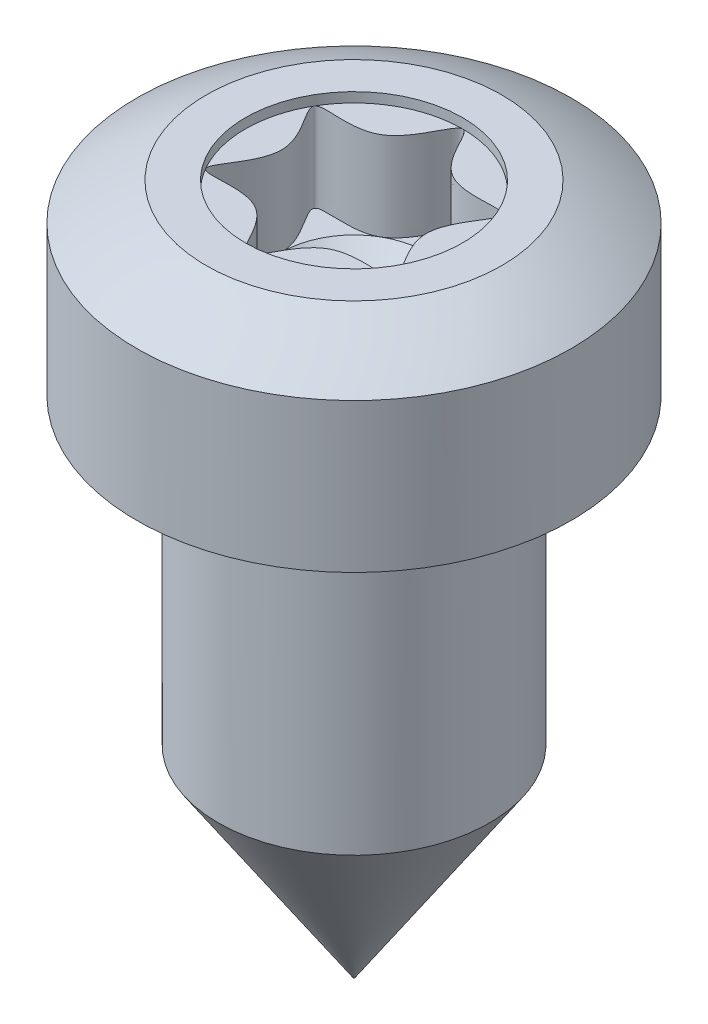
from build123d import *

# Parameters (mm, degrees)
RECESS_CUT_EXTRUDE1_DEPTH = 1.27
SKETCH5_R                 = 1.4
RECESS_CUT_EXTRUDE2_DEPTH = 0.127
FILLET1_R                 = 0.1


with BuildPart() as part:
    # Sketch1 → Body-Revolve (revolve)
    with BuildSketch(Plane.XY, mode=Mode.PRIVATE) as body_revolve_sk:
        Polygon((0, 0), (0, 8.9), (2.8, 8.9), (2.8, 6.5), (1.75, 6.5), (1.75, 0), align=None)
    revolve(body_revolve_sk.sketch.rotate(Axis((0, 0, 0), (0, 1, 0)), 90), axis=Axis((0, 0, 0), (0, 1, 0)))

    # Sketch3 → Head-Cut-Revolve (revolve, cut)
    with BuildSketch(Plane.XY, mode=Mode.PRIVATE) as head_cut_revolve_sk:
        with BuildLine():
            Line((0, 9.277536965), (0, 10.404372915))
            Line((0, 10.404372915), (5, 10.404372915))
            Line((5, 10.404372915), (5, 4.277536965))
            ThreePointArc((5, 4.277536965), (3.535533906, 7.81307087), (0, 9.277536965))
        make_face()
    revolve(head_cut_revolve_sk.sketch.rotate(Axis((0, 0, 0), (0, 1, 0)), 90), axis=Axis((0, 0, 0), (0, 1, 0)), mode=Mode.SUBTRACT)

    # Sketch4 → Recess-Cut-Extrude1 (cut)
    with BuildSketch(Plane(origin=(0, 8.9, 0), x_dir=(-1, 0, 0), z_dir=(0, 1, 0))):
        with BuildLine():
            add(Edge.make_bspline(
                [(0, -1.4), (-0.100650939, -1.4), (-0.301952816, -0.522997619), (-1.592188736, -0.919250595), (-0.603905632, 0), (-1.592188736, 0.919250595), (-0.301952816, 0.522997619), (0, 1.838501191), (0.301952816, 0.522997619), (1.592188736, 0.919250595), (0.603905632, 0), (1.592188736, -0.919250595), (0.301952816, -0.522997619), (0.100650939, -1.4), (0, -1.4)],
                knots=[0, 0, 0, 0, 0.083333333, 0.166666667, 0.25, 0.333333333, 0.416666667, 0.5, 0.583333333, 0.666666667, 0.75, 0.833333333, 0.916666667, 1, 1, 1, 1], degree=3))
        make_face()
    extrude(amount=-RECESS_CUT_EXTRUDE1_DEPTH, mode=Mode.SUBTRACT)

    # Sketch5 → Recess-Cut-Extrude2 (cut)
    with BuildSketch(Plane(origin=(0, 8.9, 0), x_dir=(-1, 0, 0), z_dir=(0, 1, 0))):
        with Locations(Location((0, 0, 0), (0, 0, 90))):
            Circle(SKETCH5_R)
    extrude(amount=-RECESS_CUT_EXTRUDE2_DEPTH, mode=Mode.SUBTRACT)

    # Sketch6 → Drill-Cut-Revolve (revolve, cut)
    with BuildSketch(Plane.XY):
        Polygon((0, 7.63), (0.933333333, 7.63), (0, 6.74), align=None)
    revolve(axis=Axis((0, 0, 0), (0, 1, 0)), mode=Mode.SUBTRACT)

    # Fillet1
    fillet1_edges = [part.edges().sort_by_distance(p)[0] for p in [
        (0, 6.5, 1.75),
    ]]
    fillet(fillet1_edges, radius=FILLET1_R)

    # Sketch7 → Body-Cut-Revolve (revolve, cut)
    with BuildSketch(Plane.XY):
        Polygon((1.75, 0), (1.75, 2.6), (0.01, 0), align=None)
    revolve(axis=Axis((0, 0, 0), (0, 1, 0)), mode=Mode.SUBTRACT)


solid = part.part
